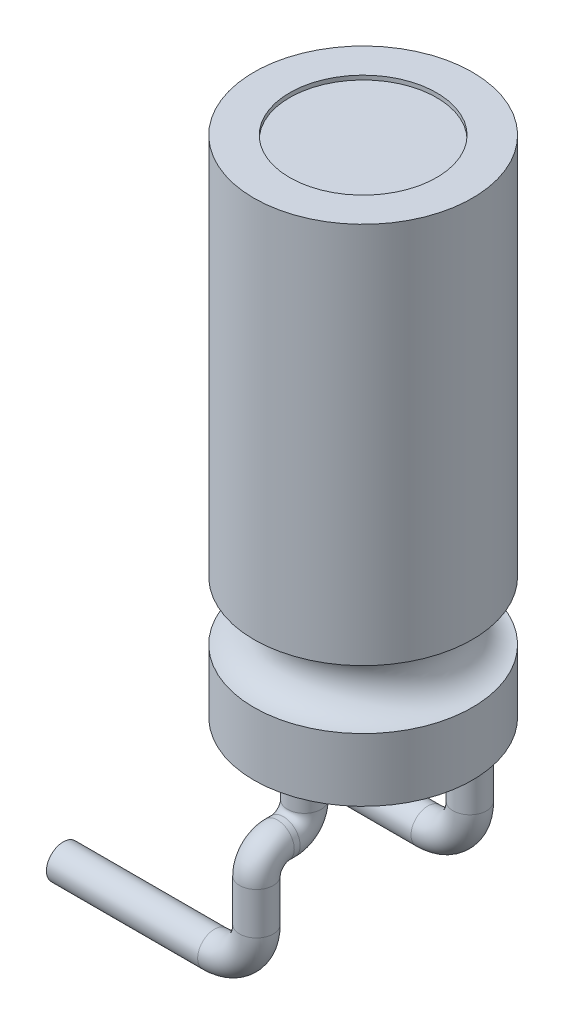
from build123d import *

# Parameters (mm, degrees)
ESQUISSE2_R             = 1.75
ENL_V_MAT_EXTRU_1_DEPTH = 0.1
ESQUISSE3_R             = 0.4
ESQUISSE5_R             = 0.4


with BuildPart() as part:
    # Esquisse1 → R_volution1 (revolve)
    with BuildSketch(Plane.XY, mode=Mode.PRIVATE) as r_volution1_sk:
        with BuildLine():
            Line((0, 39.516423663), (2.6, 39.516423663))
            Line((2.6, 39.516423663), (2.6, 30.416423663))
            ThreePointArc((2.6, 30.416423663), (1.9, 29.716423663), (2.6, 29.016423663))
            Line((2.6, 29.016423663), (2.6, 27.516423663))
            Line((2.6, 27.516423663), (0, 27.516423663))
            Line((0, 27.516423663), (0, 39.516423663))
        make_face()
    revolve(r_volution1_sk.sketch.rotate(Axis((0, 48.401709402, 0), (0, -1, 0)), 90), axis=Axis((0, 48.401709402, 0), (0, -1, 0)))

    # Esquisse2 → Enl_v. mat.-Extru.1 (cut)
    with BuildSketch(Plane(origin=(0, 39.516423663, 0), x_dir=(-1, 0, 0), z_dir=(0, 1, 0))):
        with Locations(Location((0, 0, 0), (0, 0, 90))):
            Circle(ESQUISSE2_R)
    extrude(amount=-ENL_V_MAT_EXTRU_1_DEPTH, mode=Mode.SUBTRACT)

    # Balayage1: sweep along a path in Esquisse4
    with BuildLine(Plane(origin=(0, 0, 0), x_dir=(0, 0, -1), z_dir=(1, 0, 0))) as balayage1_path:
        Line((-1.4, 27.516423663), (-1.4, 26.516423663))
        ThreePointArc((-1.4, 26.516423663), (-1.546446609, 26.162870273), (-1.9, 26.016423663))
        Line((-1.9, 26.016423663), (-2.04, 26.016423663))
        ThreePointArc((-2.04, 26.016423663), (-2.393553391, 25.869977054), (-2.54, 25.516423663))
    # Esquisse3 → Balayage1 (sweep)
    with BuildSketch(Plane.XZ.offset(-27.516423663)):
        with Locations((0, 1.4)):
            Circle(ESQUISSE3_R)
    balayage1 = sweep(path=balayage1_path.line)

    # Balayage2: sweep along a path in Esquisse6
    with BuildLine(Plane.XY.offset(2.54)) as balayage2_path:
        Line((0, 25.516423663), (0, 24.516423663))
        ThreePointArc((0, 24.516423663), (-0.292893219, 23.809316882), (-1, 23.516423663))
        Line((-1, 23.516423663), (-4.6, 23.516423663))
    # Esquisse5 → Balayage2 (sweep)
    with BuildSketch(Plane.XZ.offset(-25.516423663)):
        with Locations((0, 2.54)):
            Circle(ESQUISSE5_R)
    balayage2 = sweep(path=balayage2_path.line)

    # Sym_trie1: Balayage1, Balayage2 across plane
    add(balayage1.mirror(Plane.XY))
    add(balayage2.mirror(Plane.XY))


solid = part.part
